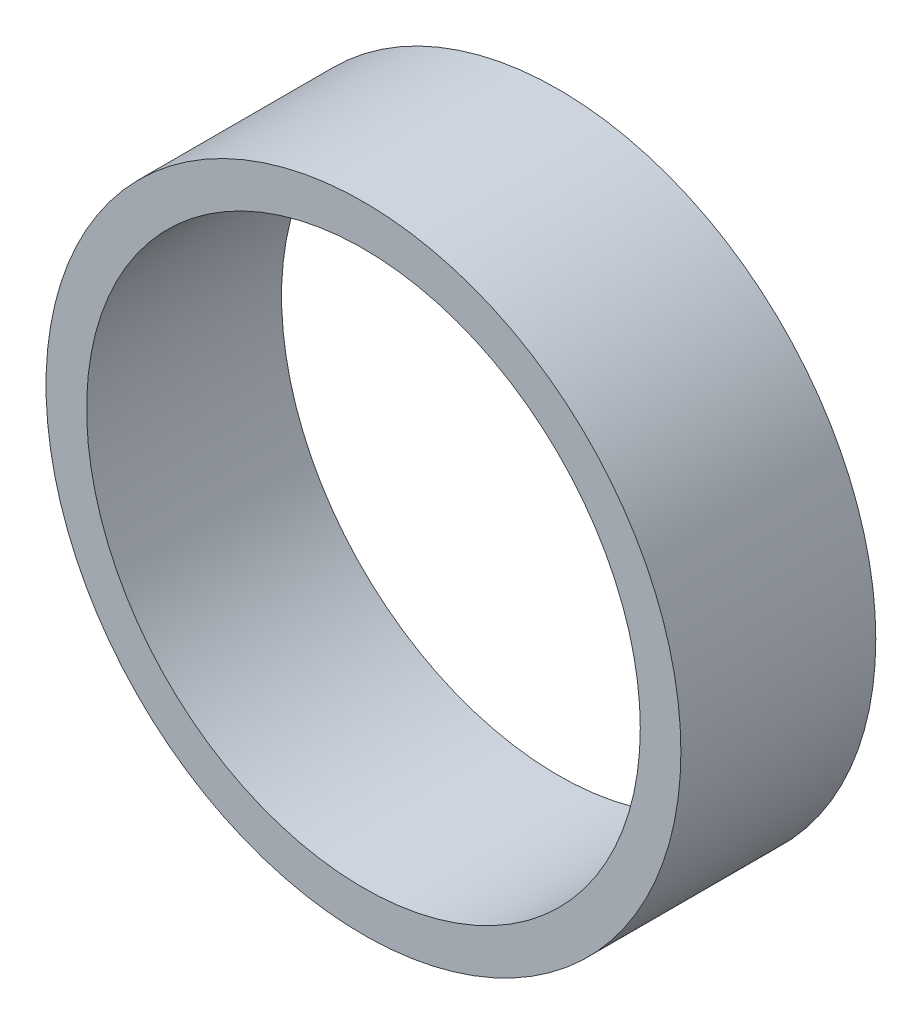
from build123d import *

# Parameters (mm, degrees)
ESQUISSE1_R      = 21.5
ESQUISSE1_R_2    = 18.75
EXTRUSION1_DEPTH = 13.2


with BuildPart() as part:
    # Esquisse1 → Extrusion1 (new body)
    with BuildSketch(Plane.XY):
        Circle(ESQUISSE1_R)
        Circle(ESQUISSE1_R_2, mode=Mode.SUBTRACT)
    extrude(amount=EXTRUSION1_DEPTH)


solid = part.part
